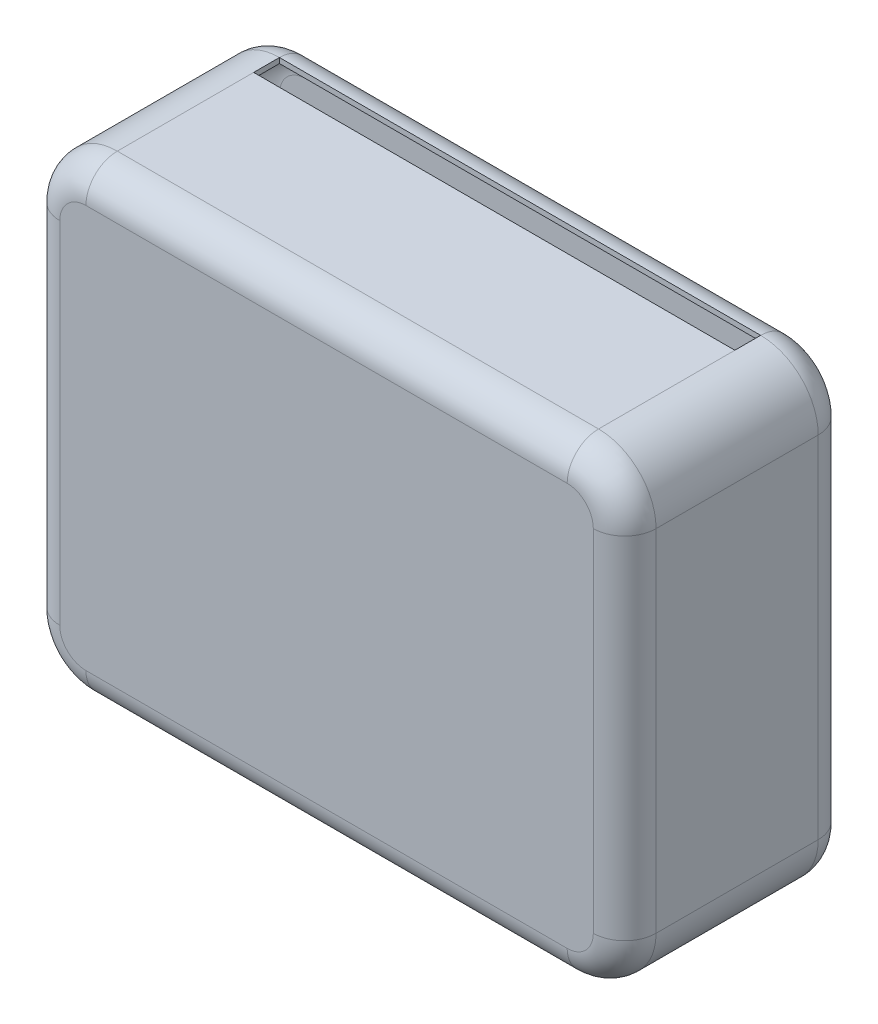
ISO-10303-21;
HEADER;
FILE_DESCRIPTION(('STEP AP214'),'2;1');
FILE_NAME('part.step','',(''),(''),'','','');
FILE_SCHEMA(('AUTOMOTIVE_DESIGN { 1 0 10303 214 1 1 1 1 }'));
ENDSEC;
DATA;
#1=APPLICATION_CONTEXT('core data for automotive mechanical design processes');
#2=APPLICATION_PROTOCOL_DEFINITION('international standard','automotive_design',2000,#1);
#3=PRODUCT_CONTEXT('',#1,'mechanical');
#4=PRODUCT('Part','Part','',(#3));
#5=PRODUCT_RELATED_PRODUCT_CATEGORY('part','',(#4));
#6=PRODUCT_DEFINITION_FORMATION('','',#4);
#7=PRODUCT_DEFINITION_CONTEXT('part definition',#1,'design');
#8=PRODUCT_DEFINITION('design','',#6,#7);
#9=PRODUCT_DEFINITION_SHAPE('','',#8);
#10=(LENGTH_UNIT() NAMED_UNIT(*) SI_UNIT(.MILLI.,.METRE.));
#11=(NAMED_UNIT(*) PLANE_ANGLE_UNIT() SI_UNIT($,.RADIAN.));
#12=(NAMED_UNIT(*) SI_UNIT($,.STERADIAN.) SOLID_ANGLE_UNIT());
#13=UNCERTAINTY_MEASURE_WITH_UNIT(LENGTH_MEASURE(1.E-05),#10,'distance_accuracy_value','');
#14=(GEOMETRIC_REPRESENTATION_CONTEXT(3) GLOBAL_UNCERTAINTY_ASSIGNED_CONTEXT((#13)) GLOBAL_UNIT_ASSIGNED_CONTEXT((#10,
#11,#12)) REPRESENTATION_CONTEXT('',''));
#15=CARTESIAN_POINT('',(0.,0.,0.));
#16=DIRECTION('',(0.,0.,1.));
#17=DIRECTION('',(1.,0.,0.));
#18=AXIS2_PLACEMENT_3D('',#15,#16,#17);
#19=CARTESIAN_POINT('',(0.,0.,41.));
#20=DIRECTION('',(-1.,0.,0.));
#21=DIRECTION('',(0.,-1.,0.));
#22=AXIS2_PLACEMENT_3D('',#19,#20,#21);
#23=PLANE('',#22);
#24=DIRECTION('',(0.,0.,-1.));
#25=VECTOR('',#24,1.);
#26=CARTESIAN_POINT('',(0.,-77.,41.));
#27=LINE('',#26,#25);
#28=CARTESIAN_POINT('',(0.,-77.,36.));
#29=VERTEX_POINT('',#28);
#30=CARTESIAN_POINT('',(0.,-77.,5.));
#31=VERTEX_POINT('',#30);
#32=EDGE_CURVE('E45',#29,#31,#27,.T.);
#33=ORIENTED_EDGE('',*,*,#32,.F.);
#34=DIRECTION('',(0.,1.,0.));
#35=VECTOR('',#34,1.);
#36=CARTESIAN_POINT('',(0.,0.,36.));
#37=LINE('',#36,#35);
#38=CARTESIAN_POINT('',(0.,-10.,36.));
#39=VERTEX_POINT('',#38);
#40=EDGE_CURVE('E151',#39,#29,#37,.F.);
#41=ORIENTED_EDGE('',*,*,#40,.F.);
#42=DIRECTION('',(0.,0.,-1.));
#43=VECTOR('',#42,1.);
#44=CARTESIAN_POINT('',(0.,-10.,41.));
#45=LINE('',#44,#43);
#46=CARTESIAN_POINT('',(0.,-10.,5.));
#47=VERTEX_POINT('',#46);
#48=EDGE_CURVE('E523',#47,#39,#45,.F.);
#49=ORIENTED_EDGE('',*,*,#48,.F.);
#50=DIRECTION('',(0.,1.,0.));
#51=VECTOR('',#50,1.);
#52=CARTESIAN_POINT('',(0.,-10.,5.));
#53=LINE('',#52,#51);
#54=EDGE_CURVE('E159',#31,#47,#53,.T.);
#55=ORIENTED_EDGE('',*,*,#54,.F.);
#56=EDGE_LOOP('',(#33,#41,#49,#55));
#57=FACE_BOUND('',#56,.T.);
#58=ADVANCED_FACE('F41',(#57),#23,.T.);
#59=CARTESIAN_POINT('',(0.,0.,41.));
#60=DIRECTION('',(0.,-1.,0.));
#61=DIRECTION('',(1.,0.,0.));
#62=AXIS2_PLACEMENT_3D('',#59,#60,#61);
#63=PLANE('',#62);
#64=DIRECTION('',(-1.,0.,0.));
#65=VECTOR('',#64,1.);
#66=CARTESIAN_POINT('',(0.,0.,9.93649130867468));
#67=LINE('',#66,#65);
#68=CARTESIAN_POINT('',(-10.,0.,9.93649130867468));
#69=VERTEX_POINT('',#68);
#70=CARTESIAN_POINT('',(-102.,0.,9.93649130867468));
#71=VERTEX_POINT('',#70);
#72=EDGE_CURVE('E394',#69,#71,#67,.T.);
#73=ORIENTED_EDGE('',*,*,#72,.F.);
#74=DIRECTION('',(0.,0.,-1.));
#75=VECTOR('',#74,1.);
#76=CARTESIAN_POINT('',(-10.,0.,41.));
#77=LINE('',#76,#75);
#78=CARTESIAN_POINT('',(-10.,0.,36.));
#79=VERTEX_POINT('',#78);
#80=EDGE_CURVE('E519',#79,#69,#77,.T.);
#81=ORIENTED_EDGE('',*,*,#80,.F.);
#82=DIRECTION('',(-1.,0.,0.));
#83=VECTOR('',#82,1.);
#84=CARTESIAN_POINT('',(0.,0.,36.));
#85=LINE('',#84,#83);
#86=CARTESIAN_POINT('',(-102.,0.,36.));
#87=VERTEX_POINT('',#86);
#88=EDGE_CURVE('E509',#87,#79,#85,.F.);
#89=ORIENTED_EDGE('',*,*,#88,.F.);
#90=DIRECTION('',(0.,0.,-1.));
#91=VECTOR('',#90,1.);
#92=CARTESIAN_POINT('',(-102.,0.,41.));
#93=LINE('',#92,#91);
#94=EDGE_CURVE('E515',#71,#87,#93,.F.);
#95=ORIENTED_EDGE('',*,*,#94,.F.);
#96=EDGE_LOOP('',(#73,#81,#89,#95));
#97=FACE_BOUND('',#96,.T.);
#98=ADVANCED_FACE('F676',(#97),#63,.T.);
#99=CARTESIAN_POINT('',(-112.,0.,41.));
#100=DIRECTION('',(1.,0.,0.));
#101=DIRECTION('',(0.,1.,0.));
#102=AXIS2_PLACEMENT_3D('',#99,#100,#101);
#103=PLANE('',#102);
#104=DIRECTION('',(0.,0.,-1.));
#105=VECTOR('',#104,1.);
#106=CARTESIAN_POINT('',(-112.,-10.,41.));
#107=LINE('',#106,#105);
#108=CARTESIAN_POINT('',(-112.,-10.,36.));
#109=VERTEX_POINT('',#108);
#110=CARTESIAN_POINT('',(-112.,-10.,5.));
#111=VERTEX_POINT('',#110);
#112=EDGE_CURVE('E506',#109,#111,#107,.T.);
#113=ORIENTED_EDGE('',*,*,#112,.F.);
#114=DIRECTION('',(0.,-1.,0.));
#115=VECTOR('',#114,1.);
#116=CARTESIAN_POINT('',(-112.,0.,36.));
#117=LINE('',#116,#115);
#118=CARTESIAN_POINT('',(-112.,-77.,36.));
#119=VERTEX_POINT('',#118);
#120=EDGE_CURVE('E498',#119,#109,#117,.F.);
#121=ORIENTED_EDGE('',*,*,#120,.F.);
#122=DIRECTION('',(0.,0.,-1.));
#123=VECTOR('',#122,1.);
#124=CARTESIAN_POINT('',(-112.,-77.,41.));
#125=LINE('',#124,#123);
#126=CARTESIAN_POINT('',(-112.,-77.,5.));
#127=VERTEX_POINT('',#126);
#128=EDGE_CURVE('E500',#127,#119,#125,.F.);
#129=ORIENTED_EDGE('',*,*,#128,.F.);
#130=DIRECTION('',(0.,-1.,0.));
#131=VECTOR('',#130,1.);
#132=CARTESIAN_POINT('',(-112.,-77.,5.));
#133=LINE('',#132,#131);
#134=EDGE_CURVE('E503',#111,#127,#133,.T.);
#135=ORIENTED_EDGE('',*,*,#134,.F.);
#136=EDGE_LOOP('',(#113,#121,#129,#135));
#137=FACE_BOUND('',#136,.T.);
#138=ADVANCED_FACE('F683',(#137),#103,.T.);
#139=CARTESIAN_POINT('',(0.,-87.,41.));
#140=DIRECTION('',(0.,1.,0.));
#141=DIRECTION('',(-1.,0.,0.));
#142=AXIS2_PLACEMENT_3D('',#139,#140,#141);
#143=PLANE('',#142);
#144=DIRECTION('',(0.,0.,-1.));
#145=VECTOR('',#144,1.);
#146=CARTESIAN_POINT('',(-102.,-87.,41.));
#147=LINE('',#146,#145);
#148=CARTESIAN_POINT('',(-102.,-87.,36.));
#149=VERTEX_POINT('',#148);
#150=CARTESIAN_POINT('',(-102.,-87.,5.));
#151=VERTEX_POINT('',#150);
#152=EDGE_CURVE('E495',#149,#151,#147,.T.);
#153=ORIENTED_EDGE('',*,*,#152,.F.);
#154=DIRECTION('',(1.,0.,0.));
#155=VECTOR('',#154,1.);
#156=CARTESIAN_POINT('',(0.,-87.,36.));
#157=LINE('',#156,#155);
#158=CARTESIAN_POINT('',(-9.99999999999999,-87.,36.));
#159=VERTEX_POINT('',#158);
#160=EDGE_CURVE('E488',#159,#149,#157,.F.);
#161=ORIENTED_EDGE('',*,*,#160,.F.);
#162=DIRECTION('',(0.,0.,-1.));
#163=VECTOR('',#162,1.);
#164=CARTESIAN_POINT('',(-9.99999999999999,-87.,41.));
#165=LINE('',#164,#163);
#166=CARTESIAN_POINT('',(-9.99999999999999,-87.,5.));
#167=VERTEX_POINT('',#166);
#168=EDGE_CURVE('E490',#167,#159,#165,.F.);
#169=ORIENTED_EDGE('',*,*,#168,.F.);
#170=DIRECTION('',(1.,0.,0.));
#171=VECTOR('',#170,1.);
#172=CARTESIAN_POINT('',(-9.99999999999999,-87.,5.));
#173=LINE('',#172,#171);
#174=EDGE_CURVE('E493',#151,#167,#173,.T.);
#175=ORIENTED_EDGE('',*,*,#174,.F.);
#176=EDGE_LOOP('',(#153,#161,#169,#175));
#177=FACE_BOUND('',#176,.T.);
#178=ADVANCED_FACE('F689',(#177),#143,.T.);
#179=CARTESIAN_POINT('',(0.,0.,41.));
#180=DIRECTION('',(0.,0.,-1.));
#181=DIRECTION('',(-1.,0.,0.));
#182=AXIS2_PLACEMENT_3D('',#179,#180,#181);
#183=PLANE('',#182);
#184=CARTESIAN_POINT('',(-10.,-10.,41.));
#185=DIRECTION('',(0.,0.,-1.));
#186=DIRECTION('',(-1.,0.,0.));
#187=AXIS2_PLACEMENT_3D('',#184,#185,#186);
#188=CIRCLE('',#187,5.);
#189=CARTESIAN_POINT('',(-5.,-10.,41.));
#190=VERTEX_POINT('',#189);
#191=CARTESIAN_POINT('',(-10.,-5.,41.));
#192=VERTEX_POINT('',#191);
#193=EDGE_CURVE('E486',#190,#192,#188,.F.);
#194=ORIENTED_EDGE('',*,*,#193,.F.);
#195=DIRECTION('',(0.,1.,0.));
#196=VECTOR('',#195,1.);
#197=CARTESIAN_POINT('',(-5.,0.,41.));
#198=LINE('',#197,#196);
#199=CARTESIAN_POINT('',(-4.99999999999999,-77.,41.));
#200=VERTEX_POINT('',#199);
#201=EDGE_CURVE('E471',#200,#190,#198,.T.);
#202=ORIENTED_EDGE('',*,*,#201,.F.);
#203=CARTESIAN_POINT('',(-9.99999999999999,-77.,41.));
#204=DIRECTION('',(0.,0.,-1.));
#205=DIRECTION('',(-1.,0.,0.));
#206=AXIS2_PLACEMENT_3D('',#203,#204,#205);
#207=CIRCLE('',#206,5.);
#208=CARTESIAN_POINT('',(-9.99999999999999,-82.,41.));
#209=VERTEX_POINT('',#208);
#210=EDGE_CURVE('E473',#209,#200,#207,.F.);
#211=ORIENTED_EDGE('',*,*,#210,.F.);
#212=DIRECTION('',(1.,0.,0.));
#213=VECTOR('',#212,1.);
#214=CARTESIAN_POINT('',(0.,-82.,41.));
#215=LINE('',#214,#213);
#216=CARTESIAN_POINT('',(-102.,-82.,41.));
#217=VERTEX_POINT('',#216);
#218=EDGE_CURVE('E475',#217,#209,#215,.T.);
#219=ORIENTED_EDGE('',*,*,#218,.F.);
#220=CARTESIAN_POINT('',(-102.,-77.,41.));
#221=DIRECTION('',(0.,0.,-1.));
#222=DIRECTION('',(-1.,0.,0.));
#223=AXIS2_PLACEMENT_3D('',#220,#221,#222);
#224=CIRCLE('',#223,5.);
#225=CARTESIAN_POINT('',(-107.,-77.,41.));
#226=VERTEX_POINT('',#225);
#227=EDGE_CURVE('E477',#226,#217,#224,.F.);
#228=ORIENTED_EDGE('',*,*,#227,.F.);
#229=DIRECTION('',(0.,-1.,0.));
#230=VECTOR('',#229,1.);
#231=CARTESIAN_POINT('',(-107.,0.,41.));
#232=LINE('',#231,#230);
#233=CARTESIAN_POINT('',(-107.,-10.,41.));
#234=VERTEX_POINT('',#233);
#235=EDGE_CURVE('E479',#234,#226,#232,.T.);
#236=ORIENTED_EDGE('',*,*,#235,.F.);
#237=CARTESIAN_POINT('',(-102.,-10.,41.));
#238=DIRECTION('',(0.,0.,-1.));
#239=DIRECTION('',(-1.,0.,0.));
#240=AXIS2_PLACEMENT_3D('',#237,#238,#239);
#241=CIRCLE('',#240,5.);
#242=CARTESIAN_POINT('',(-102.,-5.00000000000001,41.));
#243=VERTEX_POINT('',#242);
#244=EDGE_CURVE('E481',#243,#234,#241,.F.);
#245=ORIENTED_EDGE('',*,*,#244,.F.);
#246=DIRECTION('',(-1.,0.,0.));
#247=VECTOR('',#246,1.);
#248=CARTESIAN_POINT('',(0.,-5.,41.));
#249=LINE('',#248,#247);
#250=EDGE_CURVE('E483',#192,#243,#249,.T.);
#251=ORIENTED_EDGE('',*,*,#250,.F.);
#252=EDGE_LOOP('',(#194,#202,#211,#219,#228,#236,#245,#251));
#253=FACE_BOUND('',#252,.T.);
#254=ADVANCED_FACE('F693',(#253),#183,.T.);
#255=CARTESIAN_POINT('',(0.,0.,0.));
#256=DIRECTION('',(0.,0.,-1.));
#257=DIRECTION('',(-1.,0.,0.));
#258=AXIS2_PLACEMENT_3D('',#255,#256,#257);
#259=PLANE('',#258);
#260=CARTESIAN_POINT('',(-102.,-77.,0.));
#261=DIRECTION('',(0.,0.,-1.));
#262=DIRECTION('',(-1.,0.,0.));
#263=AXIS2_PLACEMENT_3D('',#260,#261,#262);
#264=CIRCLE('',#263,5.);
#265=CARTESIAN_POINT('',(-102.,-82.,0.));
#266=VERTEX_POINT('',#265);
#267=CARTESIAN_POINT('',(-107.,-77.,0.));
#268=VERTEX_POINT('',#267);
#269=EDGE_CURVE('E469',#266,#268,#264,.T.);
#270=ORIENTED_EDGE('',*,*,#269,.F.);
#271=DIRECTION('',(1.,0.,0.));
#272=VECTOR('',#271,1.);
#273=CARTESIAN_POINT('',(-102.,-82.,0.));
#274=LINE('',#273,#272);
#275=CARTESIAN_POINT('',(-9.99999999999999,-82.,0.));
#276=VERTEX_POINT('',#275);
#277=EDGE_CURVE('E454',#276,#266,#274,.F.);
#278=ORIENTED_EDGE('',*,*,#277,.F.);
#279=CARTESIAN_POINT('',(-9.99999999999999,-77.,0.));
#280=DIRECTION('',(0.,0.,-1.));
#281=DIRECTION('',(-1.,0.,0.));
#282=AXIS2_PLACEMENT_3D('',#279,#280,#281);
#283=CIRCLE('',#282,5.);
#284=CARTESIAN_POINT('',(-4.99999999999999,-77.,0.));
#285=VERTEX_POINT('',#284);
#286=EDGE_CURVE('E456',#285,#276,#283,.T.);
#287=ORIENTED_EDGE('',*,*,#286,.F.);
#288=DIRECTION('',(0.,1.,0.));
#289=VECTOR('',#288,1.);
#290=CARTESIAN_POINT('',(-4.99999999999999,-77.,0.));
#291=LINE('',#290,#289);
#292=CARTESIAN_POINT('',(-5.,-10.,0.));
#293=VERTEX_POINT('',#292);
#294=EDGE_CURVE('E458',#293,#285,#291,.F.);
#295=ORIENTED_EDGE('',*,*,#294,.F.);
#296=CARTESIAN_POINT('',(-10.,-10.,0.));
#297=DIRECTION('',(0.,0.,-1.));
#298=DIRECTION('',(-1.,0.,0.));
#299=AXIS2_PLACEMENT_3D('',#296,#297,#298);
#300=CIRCLE('',#299,5.);
#301=CARTESIAN_POINT('',(-10.,-5.,0.));
#302=VERTEX_POINT('',#301);
#303=EDGE_CURVE('E460',#302,#293,#300,.T.);
#304=ORIENTED_EDGE('',*,*,#303,.F.);
#305=DIRECTION('',(-1.,0.,0.));
#306=VECTOR('',#305,1.);
#307=CARTESIAN_POINT('',(-10.,-5.,0.));
#308=LINE('',#307,#306);
#309=CARTESIAN_POINT('',(-102.,-5.00000000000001,0.));
#310=VERTEX_POINT('',#309);
#311=EDGE_CURVE('E462',#310,#302,#308,.F.);
#312=ORIENTED_EDGE('',*,*,#311,.F.);
#313=CARTESIAN_POINT('',(-102.,-10.,0.));
#314=DIRECTION('',(0.,0.,-1.));
#315=DIRECTION('',(-1.,0.,0.));
#316=AXIS2_PLACEMENT_3D('',#313,#314,#315);
#317=CIRCLE('',#316,5.);
#318=CARTESIAN_POINT('',(-107.,-10.,0.));
#319=VERTEX_POINT('',#318);
#320=EDGE_CURVE('E464',#319,#310,#317,.T.);
#321=ORIENTED_EDGE('',*,*,#320,.F.);
#322=DIRECTION('',(0.,-1.,0.));
#323=VECTOR('',#322,1.);
#324=CARTESIAN_POINT('',(-107.,-10.,0.));
#325=LINE('',#324,#323);
#326=EDGE_CURVE('E466',#268,#319,#325,.F.);
#327=ORIENTED_EDGE('',*,*,#326,.F.);
#328=EDGE_LOOP('',(#270,#278,#287,#295,#304,#312,#321,#327));
#329=FACE_BOUND('',#328,.T.);
#330=ADVANCED_FACE('F697',(#329),#259,.F.);
#331=CARTESIAN_POINT('',(-10.,-10.,41.));
#332=DIRECTION('',(0.,0.,-1.));
#333=DIRECTION('',(-1.,0.,0.));
#334=AXIS2_PLACEMENT_3D('',#331,#332,#333);
#335=CYLINDRICAL_SURFACE('',#334,10.);
#336=ORIENTED_EDGE('',*,*,#48,.T.);
#337=CARTESIAN_POINT('',(-10.,-10.,36.));
#338=DIRECTION('',(0.,0.,-1.));
#339=DIRECTION('',(-1.,0.,0.));
#340=AXIS2_PLACEMENT_3D('',#337,#338,#339);
#341=CIRCLE('',#340,10.);
#342=EDGE_CURVE('E449',#79,#39,#341,.T.);
#343=ORIENTED_EDGE('',*,*,#342,.F.);
#344=ORIENTED_EDGE('',*,*,#80,.T.);
#345=DIRECTION('',(0.,0.,-1.));
#346=VECTOR('',#345,1.);
#347=CARTESIAN_POINT('',(-10.,0.,41.));
#348=LINE('',#347,#346);
#349=CARTESIAN_POINT('',(-10.,0.,5.));
#350=VERTEX_POINT('',#349);
#351=EDGE_CURVE('E559',#69,#350,#348,.T.);
#352=ORIENTED_EDGE('',*,*,#351,.T.);
#353=CARTESIAN_POINT('',(-10.,-10.,5.));
#354=DIRECTION('',(0.,0.,-1.));
#355=DIRECTION('',(-1.,0.,0.));
#356=AXIS2_PLACEMENT_3D('',#353,#354,#355);
#357=CIRCLE('',#356,10.);
#358=EDGE_CURVE('E451',#47,#350,#357,.F.);
#359=ORIENTED_EDGE('',*,*,#358,.F.);
#360=EDGE_LOOP('',(#336,#343,#344,#352,#359));
#361=FACE_BOUND('',#360,.T.);
#362=ADVANCED_FACE('F701',(#361),#335,.F.);
#363=CARTESIAN_POINT('',(-102.,-10.,41.));
#364=DIRECTION('',(0.,0.,-1.));
#365=DIRECTION('',(-1.,0.,0.));
#366=AXIS2_PLACEMENT_3D('',#363,#364,#365);
#367=CYLINDRICAL_SURFACE('',#366,10.);
#368=CARTESIAN_POINT('',(-102.,0.,5.));
#369=VERTEX_POINT('',#368);
#370=EDGE_CURVE('E512',#369,#71,#93,.F.);
#371=ORIENTED_EDGE('',*,*,#370,.T.);
#372=ORIENTED_EDGE('',*,*,#94,.T.);
#373=CARTESIAN_POINT('',(-102.,-10.,36.));
#374=DIRECTION('',(0.,0.,-1.));
#375=DIRECTION('',(-1.,0.,0.));
#376=AXIS2_PLACEMENT_3D('',#373,#374,#375);
#377=CIRCLE('',#376,10.);
#378=EDGE_CURVE('E445',#109,#87,#377,.T.);
#379=ORIENTED_EDGE('',*,*,#378,.F.);
#380=ORIENTED_EDGE('',*,*,#112,.T.);
#381=CARTESIAN_POINT('',(-102.,-10.,5.));
#382=DIRECTION('',(0.,0.,-1.));
#383=DIRECTION('',(-1.,0.,0.));
#384=AXIS2_PLACEMENT_3D('',#381,#382,#383);
#385=CIRCLE('',#384,10.);
#386=EDGE_CURVE('E447',#369,#111,#385,.F.);
#387=ORIENTED_EDGE('',*,*,#386,.F.);
#388=EDGE_LOOP('',(#371,#372,#379,#380,#387));
#389=FACE_BOUND('',#388,.T.);
#390=ADVANCED_FACE('F705',(#389),#367,.F.);
#391=CARTESIAN_POINT('',(-9.99999999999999,-77.,41.));
#392=DIRECTION('',(0.,0.,-1.));
#393=DIRECTION('',(-1.,0.,0.));
#394=AXIS2_PLACEMENT_3D('',#391,#392,#393);
#395=CYLINDRICAL_SURFACE('',#394,10.);
#396=ORIENTED_EDGE('',*,*,#168,.T.);
#397=CARTESIAN_POINT('',(-9.99999999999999,-77.,36.));
#398=DIRECTION('',(0.,0.,-1.));
#399=DIRECTION('',(-1.,0.,0.));
#400=AXIS2_PLACEMENT_3D('',#397,#398,#399);
#401=CIRCLE('',#400,10.);
#402=EDGE_CURVE('E441',#29,#159,#401,.T.);
#403=ORIENTED_EDGE('',*,*,#402,.F.);
#404=ORIENTED_EDGE('',*,*,#32,.T.);
#405=CARTESIAN_POINT('',(-9.99999999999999,-77.,5.));
#406=DIRECTION('',(0.,0.,-1.));
#407=DIRECTION('',(-1.,0.,0.));
#408=AXIS2_PLACEMENT_3D('',#405,#406,#407);
#409=CIRCLE('',#408,10.);
#410=EDGE_CURVE('E443',#167,#31,#409,.F.);
#411=ORIENTED_EDGE('',*,*,#410,.F.);
#412=EDGE_LOOP('',(#396,#403,#404,#411));
#413=FACE_BOUND('',#412,.T.);
#414=ADVANCED_FACE('F709',(#413),#395,.F.);
#415=CARTESIAN_POINT('',(-102.,-77.,41.));
#416=DIRECTION('',(0.,0.,-1.));
#417=DIRECTION('',(-1.,0.,0.));
#418=AXIS2_PLACEMENT_3D('',#415,#416,#417);
#419=CYLINDRICAL_SURFACE('',#418,10.);
#420=ORIENTED_EDGE('',*,*,#128,.T.);
#421=CARTESIAN_POINT('',(-102.,-77.,36.));
#422=DIRECTION('',(0.,0.,-1.));
#423=DIRECTION('',(-1.,0.,0.));
#424=AXIS2_PLACEMENT_3D('',#421,#422,#423);
#425=CIRCLE('',#424,10.);
#426=EDGE_CURVE('E437',#149,#119,#425,.T.);
#427=ORIENTED_EDGE('',*,*,#426,.F.);
#428=ORIENTED_EDGE('',*,*,#152,.T.);
#429=CARTESIAN_POINT('',(-102.,-77.,5.));
#430=DIRECTION('',(0.,0.,-1.));
#431=DIRECTION('',(-1.,0.,0.));
#432=AXIS2_PLACEMENT_3D('',#429,#430,#431);
#433=CIRCLE('',#432,10.);
#434=EDGE_CURVE('E439',#127,#151,#433,.F.);
#435=ORIENTED_EDGE('',*,*,#434,.F.);
#436=EDGE_LOOP('',(#420,#427,#428,#435));
#437=FACE_BOUND('',#436,.T.);
#438=ADVANCED_FACE('F713',(#437),#419,.F.);
#439=CARTESIAN_POINT('',(-5.,0.,5.));
#440=DIRECTION('',(0.,-1.,0.));
#441=DIRECTION('',(1.,0.,0.));
#442=AXIS2_PLACEMENT_3D('',#439,#440,#441);
#443=CYLINDRICAL_SURFACE('',#442,5.);
#444=CARTESIAN_POINT('',(-4.99999999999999,-77.,5.));
#445=DIRECTION('',(0.,-1.,0.));
#446=DIRECTION('',(0.,0.,-1.));
#447=AXIS2_PLACEMENT_3D('',#444,#445,#446);
#448=CIRCLE('',#447,5.);
#449=EDGE_CURVE('E433',#285,#31,#448,.T.);
#450=ORIENTED_EDGE('',*,*,#449,.T.);
#451=ORIENTED_EDGE('',*,*,#54,.T.);
#452=CARTESIAN_POINT('',(-5.,-10.,5.));
#453=DIRECTION('',(0.,1.,0.));
#454=DIRECTION('',(0.,0.,1.));
#455=AXIS2_PLACEMENT_3D('',#452,#453,#454);
#456=CIRCLE('',#455,5.);
#457=EDGE_CURVE('E435',#47,#293,#456,.T.);
#458=ORIENTED_EDGE('',*,*,#457,.T.);
#459=ORIENTED_EDGE('',*,*,#294,.T.);
#460=EDGE_LOOP('',(#450,#451,#458,#459));
#461=FACE_BOUND('',#460,.T.);
#462=ADVANCED_FACE('F716',(#461),#443,.F.);
#463=CARTESIAN_POINT('',(-10.,-10.,5.));
#464=DIRECTION('',(0.,0.,-1.));
#465=DIRECTION('',(-1.,0.,0.));
#466=AXIS2_PLACEMENT_3D('',#463,#464,#465);
#467=DEGENERATE_TOROIDAL_SURFACE('',#466,5.,5.,.T.);
#468=ORIENTED_EDGE('',*,*,#457,.F.);
#469=ORIENTED_EDGE('',*,*,#358,.T.);
#470=CARTESIAN_POINT('',(-10.,-5.,5.));
#471=DIRECTION('',(-1.,0.,0.));
#472=DIRECTION('',(0.,-1.,0.));
#473=AXIS2_PLACEMENT_3D('',#470,#471,#472);
#474=CIRCLE('',#473,5.);
#475=EDGE_CURVE('E430',#350,#302,#474,.T.);
#476=ORIENTED_EDGE('',*,*,#475,.T.);
#477=ORIENTED_EDGE('',*,*,#303,.T.);
#478=EDGE_LOOP('',(#468,#469,#476,#477));
#479=FACE_BOUND('',#478,.T.);
#480=ADVANCED_FACE('F720',(#479),#467,.F.);
#481=CARTESIAN_POINT('',(-9.99999999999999,-77.,5.));
#482=DIRECTION('',(0.,0.,-1.));
#483=DIRECTION('',(-1.,0.,0.));
#484=AXIS2_PLACEMENT_3D('',#481,#482,#483);
#485=DEGENERATE_TOROIDAL_SURFACE('',#484,5.,5.,.T.);
#486=ORIENTED_EDGE('',*,*,#449,.F.);
#487=ORIENTED_EDGE('',*,*,#286,.T.);
#488=CARTESIAN_POINT('',(-9.99999999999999,-82.,5.));
#489=DIRECTION('',(-1.,0.,0.));
#490=DIRECTION('',(0.,0.,1.));
#491=AXIS2_PLACEMENT_3D('',#488,#489,#490);
#492=CIRCLE('',#491,5.);
#493=EDGE_CURVE('E427',#276,#167,#492,.T.);
#494=ORIENTED_EDGE('',*,*,#493,.T.);
#495=ORIENTED_EDGE('',*,*,#410,.T.);
#496=EDGE_LOOP('',(#486,#487,#494,#495));
#497=FACE_BOUND('',#496,.T.);
#498=ADVANCED_FACE('F723',(#497),#485,.F.);
#499=CARTESIAN_POINT('',(0.,-5.,5.));
#500=DIRECTION('',(1.,0.,0.));
#501=DIRECTION('',(0.,1.,0.));
#502=AXIS2_PLACEMENT_3D('',#499,#500,#501);
#503=CYLINDRICAL_SURFACE('',#502,5.);
#504=ORIENTED_EDGE('',*,*,#475,.F.);
#505=DIRECTION('',(-1.,0.,0.));
#506=VECTOR('',#505,1.);
#507=CARTESIAN_POINT('',(-102.,0.,5.));
#508=LINE('',#507,#506);
#509=EDGE_CURVE('E516',#350,#369,#508,.T.);
#510=ORIENTED_EDGE('',*,*,#509,.T.);
#511=CARTESIAN_POINT('',(-102.,-5.00000000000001,5.));
#512=DIRECTION('',(-1.,0.,0.));
#513=DIRECTION('',(0.,0.,1.));
#514=AXIS2_PLACEMENT_3D('',#511,#512,#513);
#515=CIRCLE('',#514,5.);
#516=EDGE_CURVE('E424',#369,#310,#515,.T.);
#517=ORIENTED_EDGE('',*,*,#516,.T.);
#518=ORIENTED_EDGE('',*,*,#311,.T.);
#519=EDGE_LOOP('',(#504,#510,#517,#518));
#520=FACE_BOUND('',#519,.T.);
#521=ADVANCED_FACE('F727',(#520),#503,.F.);
#522=CARTESIAN_POINT('',(0.,-82.,5.));
#523=DIRECTION('',(-1.,0.,0.));
#524=DIRECTION('',(0.,-1.,0.));
#525=AXIS2_PLACEMENT_3D('',#522,#523,#524);
#526=CYLINDRICAL_SURFACE('',#525,5.);
#527=ORIENTED_EDGE('',*,*,#493,.F.);
#528=ORIENTED_EDGE('',*,*,#277,.T.);
#529=CARTESIAN_POINT('',(-102.,-82.,5.));
#530=DIRECTION('',(-1.,0.,0.));
#531=DIRECTION('',(0.,0.,1.));
#532=AXIS2_PLACEMENT_3D('',#529,#530,#531);
#533=CIRCLE('',#532,5.);
#534=EDGE_CURVE('E421',#266,#151,#533,.T.);
#535=ORIENTED_EDGE('',*,*,#534,.T.);
#536=ORIENTED_EDGE('',*,*,#174,.T.);
#537=EDGE_LOOP('',(#527,#528,#535,#536));
#538=FACE_BOUND('',#537,.T.);
#539=ADVANCED_FACE('F731',(#538),#526,.F.);
#540=CARTESIAN_POINT('',(-102.,-10.,5.));
#541=DIRECTION('',(0.,0.,-1.));
#542=DIRECTION('',(-1.,0.,0.));
#543=AXIS2_PLACEMENT_3D('',#540,#541,#542);
#544=DEGENERATE_TOROIDAL_SURFACE('',#543,5.,5.,.T.);
#545=ORIENTED_EDGE('',*,*,#516,.F.);
#546=ORIENTED_EDGE('',*,*,#386,.T.);
#547=CARTESIAN_POINT('',(-107.,-10.,5.));
#548=DIRECTION('',(0.,-1.,0.));
#549=DIRECTION('',(1.,0.,0.));
#550=AXIS2_PLACEMENT_3D('',#547,#548,#549);
#551=CIRCLE('',#550,5.);
#552=EDGE_CURVE('E419',#111,#319,#551,.T.);
#553=ORIENTED_EDGE('',*,*,#552,.T.);
#554=ORIENTED_EDGE('',*,*,#320,.T.);
#555=EDGE_LOOP('',(#545,#546,#553,#554));
#556=FACE_BOUND('',#555,.T.);
#557=ADVANCED_FACE('F735',(#556),#544,.F.);
#558=CARTESIAN_POINT('',(-102.,-77.,5.));
#559=DIRECTION('',(0.,0.,-1.));
#560=DIRECTION('',(-1.,0.,0.));
#561=AXIS2_PLACEMENT_3D('',#558,#559,#560);
#562=DEGENERATE_TOROIDAL_SURFACE('',#561,5.,5.,.T.);
#563=ORIENTED_EDGE('',*,*,#534,.F.);
#564=ORIENTED_EDGE('',*,*,#269,.T.);
#565=CARTESIAN_POINT('',(-107.,-77.,5.));
#566=DIRECTION('',(0.,1.,0.));
#567=DIRECTION('',(0.,0.,1.));
#568=AXIS2_PLACEMENT_3D('',#565,#566,#567);
#569=CIRCLE('',#568,5.);
#570=EDGE_CURVE('E417',#268,#127,#569,.T.);
#571=ORIENTED_EDGE('',*,*,#570,.T.);
#572=ORIENTED_EDGE('',*,*,#434,.T.);
#573=EDGE_LOOP('',(#563,#564,#571,#572));
#574=FACE_BOUND('',#573,.T.);
#575=ADVANCED_FACE('F739',(#574),#562,.F.);
#576=CARTESIAN_POINT('',(-107.,0.,5.));
#577=DIRECTION('',(0.,1.,0.));
#578=DIRECTION('',(-1.,0.,0.));
#579=AXIS2_PLACEMENT_3D('',#576,#577,#578);
#580=CYLINDRICAL_SURFACE('',#579,5.);
#581=ORIENTED_EDGE('',*,*,#552,.F.);
#582=ORIENTED_EDGE('',*,*,#134,.T.);
#583=ORIENTED_EDGE('',*,*,#570,.F.);
#584=ORIENTED_EDGE('',*,*,#326,.T.);
#585=EDGE_LOOP('',(#581,#582,#583,#584));
#586=FACE_BOUND('',#585,.T.);
#587=ADVANCED_FACE('F743',(#586),#580,.F.);
#588=CARTESIAN_POINT('',(0.,-82.,36.));
#589=DIRECTION('',(1.,0.,0.));
#590=DIRECTION('',(0.,1.,0.));
#591=AXIS2_PLACEMENT_3D('',#588,#589,#590);
#592=CYLINDRICAL_SURFACE('',#591,5.);
#593=CARTESIAN_POINT('',(-102.,-82.,36.));
#594=DIRECTION('',(-1.,0.,0.));
#595=DIRECTION('',(0.,0.,1.));
#596=AXIS2_PLACEMENT_3D('',#593,#594,#595);
#597=CIRCLE('',#596,5.);
#598=EDGE_CURVE('E411',#149,#217,#597,.T.);
#599=ORIENTED_EDGE('',*,*,#598,.T.);
#600=ORIENTED_EDGE('',*,*,#218,.T.);
#601=CARTESIAN_POINT('',(-9.99999999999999,-82.,36.));
#602=DIRECTION('',(1.,0.,0.));
#603=DIRECTION('',(0.,1.,0.));
#604=AXIS2_PLACEMENT_3D('',#601,#602,#603);
#605=CIRCLE('',#604,5.);
#606=EDGE_CURVE('E414',#209,#159,#605,.T.);
#607=ORIENTED_EDGE('',*,*,#606,.T.);
#608=ORIENTED_EDGE('',*,*,#160,.T.);
#609=EDGE_LOOP('',(#599,#600,#607,#608));
#610=FACE_BOUND('',#609,.T.);
#611=ADVANCED_FACE('F747',(#610),#592,.F.);
#612=CARTESIAN_POINT('',(-9.99999999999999,-77.,36.));
#613=DIRECTION('',(0.,0.,-1.));
#614=DIRECTION('',(-1.,0.,0.));
#615=AXIS2_PLACEMENT_3D('',#612,#613,#614);
#616=DEGENERATE_TOROIDAL_SURFACE('',#615,5.,5.,.T.);
#617=ORIENTED_EDGE('',*,*,#606,.F.);
#618=ORIENTED_EDGE('',*,*,#210,.T.);
#619=CARTESIAN_POINT('',(-4.99999999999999,-77.,36.));
#620=DIRECTION('',(0.,1.,0.));
#621=DIRECTION('',(0.,0.,1.));
#622=AXIS2_PLACEMENT_3D('',#619,#620,#621);
#623=CIRCLE('',#622,5.);
#624=EDGE_CURVE('E408',#200,#29,#623,.T.);
#625=ORIENTED_EDGE('',*,*,#624,.T.);
#626=ORIENTED_EDGE('',*,*,#402,.T.);
#627=EDGE_LOOP('',(#617,#618,#625,#626));
#628=FACE_BOUND('',#627,.T.);
#629=ADVANCED_FACE('F751',(#628),#616,.F.);
#630=CARTESIAN_POINT('',(-102.,-77.,36.));
#631=DIRECTION('',(0.,0.,-1.));
#632=DIRECTION('',(-1.,0.,0.));
#633=AXIS2_PLACEMENT_3D('',#630,#631,#632);
#634=DEGENERATE_TOROIDAL_SURFACE('',#633,5.,5.,.T.);
#635=ORIENTED_EDGE('',*,*,#598,.F.);
#636=ORIENTED_EDGE('',*,*,#426,.T.);
#637=CARTESIAN_POINT('',(-107.,-77.,36.));
#638=DIRECTION('',(0.,1.,0.));
#639=DIRECTION('',(0.,0.,1.));
#640=AXIS2_PLACEMENT_3D('',#637,#638,#639);
#641=CIRCLE('',#640,5.);
#642=EDGE_CURVE('E405',#119,#226,#641,.T.);
#643=ORIENTED_EDGE('',*,*,#642,.T.);
#644=ORIENTED_EDGE('',*,*,#227,.T.);
#645=EDGE_LOOP('',(#635,#636,#643,#644));
#646=FACE_BOUND('',#645,.T.);
#647=ADVANCED_FACE('F755',(#646),#634,.F.);
#648=CARTESIAN_POINT('',(-5.,0.,36.));
#649=DIRECTION('',(0.,1.,0.));
#650=DIRECTION('',(-1.,0.,0.));
#651=AXIS2_PLACEMENT_3D('',#648,#649,#650);
#652=CYLINDRICAL_SURFACE('',#651,5.);
#653=ORIENTED_EDGE('',*,*,#624,.F.);
#654=ORIENTED_EDGE('',*,*,#201,.T.);
#655=CARTESIAN_POINT('',(-5.,-10.,36.));
#656=DIRECTION('',(0.,1.,0.));
#657=DIRECTION('',(-1.,0.,0.));
#658=AXIS2_PLACEMENT_3D('',#655,#656,#657);
#659=CIRCLE('',#658,5.);
#660=EDGE_CURVE('E403',#190,#39,#659,.T.);
#661=ORIENTED_EDGE('',*,*,#660,.T.);
#662=ORIENTED_EDGE('',*,*,#40,.T.);
#663=EDGE_LOOP('',(#653,#654,#661,#662));
#664=FACE_BOUND('',#663,.T.);
#665=ADVANCED_FACE('F759',(#664),#652,.F.);
#666=CARTESIAN_POINT('',(-107.,0.,36.));
#667=DIRECTION('',(0.,-1.,0.));
#668=DIRECTION('',(1.,0.,0.));
#669=AXIS2_PLACEMENT_3D('',#666,#667,#668);
#670=CYLINDRICAL_SURFACE('',#669,5.);
#671=ORIENTED_EDGE('',*,*,#642,.F.);
#672=ORIENTED_EDGE('',*,*,#120,.T.);
#673=CARTESIAN_POINT('',(-107.,-10.,36.));
#674=DIRECTION('',(0.,1.,0.));
#675=DIRECTION('',(0.,0.,1.));
#676=AXIS2_PLACEMENT_3D('',#673,#674,#675);
#677=CIRCLE('',#676,5.);
#678=EDGE_CURVE('E400',#109,#234,#677,.T.);
#679=ORIENTED_EDGE('',*,*,#678,.T.);
#680=ORIENTED_EDGE('',*,*,#235,.T.);
#681=EDGE_LOOP('',(#671,#672,#679,#680));
#682=FACE_BOUND('',#681,.T.);
#683=ADVANCED_FACE('F763',(#682),#670,.F.);
#684=CARTESIAN_POINT('',(-10.,-10.,36.));
#685=DIRECTION('',(0.,0.,-1.));
#686=DIRECTION('',(-1.,0.,0.));
#687=AXIS2_PLACEMENT_3D('',#684,#685,#686);
#688=DEGENERATE_TOROIDAL_SURFACE('',#687,5.,5.,.T.);
#689=ORIENTED_EDGE('',*,*,#660,.F.);
#690=ORIENTED_EDGE('',*,*,#193,.T.);
#691=CARTESIAN_POINT('',(-10.,-5.,36.));
#692=DIRECTION('',(-1.,0.,0.));
#693=DIRECTION('',(0.,0.,1.));
#694=AXIS2_PLACEMENT_3D('',#691,#692,#693);
#695=CIRCLE('',#694,5.);
#696=EDGE_CURVE('E51',#192,#79,#695,.T.);
#697=ORIENTED_EDGE('',*,*,#696,.T.);
#698=ORIENTED_EDGE('',*,*,#342,.T.);
#699=EDGE_LOOP('',(#689,#690,#697,#698));
#700=FACE_BOUND('',#699,.T.);
#701=ADVANCED_FACE('F766',(#700),#688,.F.);
#702=CARTESIAN_POINT('',(-102.,-10.,36.));
#703=DIRECTION('',(0.,0.,-1.));
#704=DIRECTION('',(-1.,0.,0.));
#705=AXIS2_PLACEMENT_3D('',#702,#703,#704);
#706=DEGENERATE_TOROIDAL_SURFACE('',#705,5.,5.,.T.);
#707=ORIENTED_EDGE('',*,*,#678,.F.);
#708=ORIENTED_EDGE('',*,*,#378,.T.);
#709=CARTESIAN_POINT('',(-102.,-5.00000000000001,36.));
#710=DIRECTION('',(1.,0.,0.));
#711=DIRECTION('',(0.,0.,-1.));
#712=AXIS2_PLACEMENT_3D('',#709,#710,#711);
#713=CIRCLE('',#712,5.);
#714=EDGE_CURVE('E11',#87,#243,#713,.T.);
#715=ORIENTED_EDGE('',*,*,#714,.T.);
#716=ORIENTED_EDGE('',*,*,#244,.T.);
#717=EDGE_LOOP('',(#707,#708,#715,#716));
#718=FACE_BOUND('',#717,.T.);
#719=ADVANCED_FACE('F769',(#718),#706,.F.);
#720=CARTESIAN_POINT('',(0.,-5.,36.));
#721=DIRECTION('',(-1.,0.,0.));
#722=DIRECTION('',(0.,-1.,0.));
#723=AXIS2_PLACEMENT_3D('',#720,#721,#722);
#724=CYLINDRICAL_SURFACE('',#723,5.);
#725=ORIENTED_EDGE('',*,*,#696,.F.);
#726=ORIENTED_EDGE('',*,*,#250,.T.);
#727=ORIENTED_EDGE('',*,*,#714,.F.);
#728=ORIENTED_EDGE('',*,*,#88,.T.);
#729=EDGE_LOOP('',(#725,#726,#727,#728));
#730=FACE_BOUND('',#729,.T.);
#731=ADVANCED_FACE('F43',(#730),#724,.F.);
#732=CARTESIAN_POINT('',(-10.,-9.,5.));
#733=DIRECTION('',(1.,0.,0.));
#734=DIRECTION('',(0.,1.,0.));
#735=AXIS2_PLACEMENT_3D('',#732,#733,#734);
#736=PLANE('',#735);
#737=DIRECTION('',(0.,1.,0.));
#738=VECTOR('',#737,1.);
#739=CARTESIAN_POINT('',(-10.,-9.,9.93649130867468));
#740=LINE('',#739,#738);
#741=CARTESIAN_POINT('',(-10.,0.999999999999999,9.93649130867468));
#742=VERTEX_POINT('',#741);
#743=EDGE_CURVE('E562',#69,#742,#740,.T.);
#744=ORIENTED_EDGE('',*,*,#743,.T.);
#745=DIRECTION('',(0.,0.,-1.));
#746=VECTOR('',#745,1.);
#747=CARTESIAN_POINT('',(-10.,0.999999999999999,5.));
#748=LINE('',#747,#746);
#749=CARTESIAN_POINT('',(-10.,0.999999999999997,5.));
#750=VERTEX_POINT('',#749);
#751=EDGE_CURVE('E577',#742,#750,#748,.T.);
#752=ORIENTED_EDGE('',*,*,#751,.T.);
#753=DIRECTION('',(0.,1.,0.));
#754=VECTOR('',#753,1.);
#755=CARTESIAN_POINT('',(-10.,-9.,5.));
#756=LINE('',#755,#754);
#757=EDGE_CURVE('E563',#350,#750,#756,.T.);
#758=ORIENTED_EDGE('',*,*,#757,.F.);
#759=ORIENTED_EDGE('',*,*,#351,.F.);
#760=EDGE_LOOP('',(#744,#752,#758,#759));
#761=FACE_BOUND('',#760,.T.);
#762=ADVANCED_FACE('F581',(#761),#736,.F.);
#763=CARTESIAN_POINT('',(-102.,-9.00000000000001,5.));
#764=DIRECTION('',(-1.,0.,0.));
#765=DIRECTION('',(0.,-1.,0.));
#766=AXIS2_PLACEMENT_3D('',#763,#764,#765);
#767=PLANE('',#766);
#768=DIRECTION('',(0.,1.,0.));
#769=VECTOR('',#768,1.);
#770=CARTESIAN_POINT('',(-102.,-9.00000000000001,5.));
#771=LINE('',#770,#769);
#772=CARTESIAN_POINT('',(-102.,0.999999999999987,5.));
#773=VERTEX_POINT('',#772);
#774=EDGE_CURVE('E566',#369,#773,#771,.T.);
#775=ORIENTED_EDGE('',*,*,#774,.T.);
#776=DIRECTION('',(0.,0.,1.));
#777=VECTOR('',#776,1.);
#778=CARTESIAN_POINT('',(-102.,0.999999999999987,41.));
#779=LINE('',#778,#777);
#780=CARTESIAN_POINT('',(-102.,0.999999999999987,9.93649130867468));
#781=VERTEX_POINT('',#780);
#782=EDGE_CURVE('E540',#773,#781,#779,.T.);
#783=ORIENTED_EDGE('',*,*,#782,.T.);
#784=DIRECTION('',(0.,1.,0.));
#785=VECTOR('',#784,1.);
#786=CARTESIAN_POINT('',(-102.,-9.00000000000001,9.93649130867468));
#787=LINE('',#786,#785);
#788=EDGE_CURVE('E570',#71,#781,#787,.T.);
#789=ORIENTED_EDGE('',*,*,#788,.F.);
#790=ORIENTED_EDGE('',*,*,#370,.F.);
#791=EDGE_LOOP('',(#775,#783,#789,#790));
#792=FACE_BOUND('',#791,.T.);
#793=ADVANCED_FACE('F798',(#792),#767,.F.);
#794=CARTESIAN_POINT('',(-10.,-9.,5.));
#795=DIRECTION('',(0.,0.,-1.));
#796=DIRECTION('',(-1.,0.,0.));
#797=AXIS2_PLACEMENT_3D('',#794,#795,#796);
#798=PLANE('',#797);
#799=ORIENTED_EDGE('',*,*,#757,.T.);
#800=DIRECTION('',(1.,0.,0.));
#801=VECTOR('',#800,1.);
#802=CARTESIAN_POINT('',(0.,1.,5.));
#803=LINE('',#802,#801);
#804=EDGE_CURVE('E378',#750,#773,#803,.F.);
#805=ORIENTED_EDGE('',*,*,#804,.T.);
#806=ORIENTED_EDGE('',*,*,#774,.F.);
#807=ORIENTED_EDGE('',*,*,#509,.F.);
#808=EDGE_LOOP('',(#799,#805,#806,#807));
#809=FACE_BOUND('',#808,.T.);
#810=ADVANCED_FACE('F588',(#809),#798,.F.);
#811=CARTESIAN_POINT('',(-10.,-9.,9.93649130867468));
#812=DIRECTION('',(0.,0.,1.));
#813=DIRECTION('',(1.,0.,0.));
#814=AXIS2_PLACEMENT_3D('',#811,#812,#813);
#815=PLANE('',#814);
#816=ORIENTED_EDGE('',*,*,#72,.T.);
#817=ORIENTED_EDGE('',*,*,#788,.T.);
#818=DIRECTION('',(1.,0.,0.));
#819=VECTOR('',#818,1.);
#820=CARTESIAN_POINT('',(-10.,0.999999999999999,9.93649130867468));
#821=LINE('',#820,#819);
#822=EDGE_CURVE('E567',#781,#742,#821,.T.);
#823=ORIENTED_EDGE('',*,*,#822,.T.);
#824=ORIENTED_EDGE('',*,*,#743,.F.);
#825=EDGE_LOOP('',(#816,#817,#823,#824));
#826=FACE_BOUND('',#825,.T.);
#827=ADVANCED_FACE('F795',(#826),#815,.F.);
#828=CARTESIAN_POINT('',(1.,0.,41.));
#829=DIRECTION('',(-1.,0.,0.));
#830=DIRECTION('',(0.,-1.,0.));
#831=AXIS2_PLACEMENT_3D('',#828,#829,#830);
#832=PLANE('',#831);
#833=DIRECTION('',(0.,0.,1.));
#834=VECTOR('',#833,1.);
#835=CARTESIAN_POINT('',(1.00000000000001,-77.,41.));
#836=LINE('',#835,#834);
#837=CARTESIAN_POINT('',(1.00000000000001,-77.,36.));
#838=VERTEX_POINT('',#837);
#839=CARTESIAN_POINT('',(1.00000000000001,-77.,5.));
#840=VERTEX_POINT('',#839);
#841=EDGE_CURVE('E309',#838,#840,#836,.F.);
#842=ORIENTED_EDGE('',*,*,#841,.T.);
#843=DIRECTION('',(0.,-1.,0.));
#844=VECTOR('',#843,1.);
#845=CARTESIAN_POINT('',(1.,0.,5.));
#846=LINE('',#845,#844);
#847=CARTESIAN_POINT('',(1.,-10.,5.));
#848=VERTEX_POINT('',#847);
#849=EDGE_CURVE('E547',#840,#848,#846,.F.);
#850=ORIENTED_EDGE('',*,*,#849,.T.);
#851=DIRECTION('',(0.,0.,1.));
#852=VECTOR('',#851,1.);
#853=CARTESIAN_POINT('',(1.,-10.,41.));
#854=LINE('',#853,#852);
#855=CARTESIAN_POINT('',(1.,-10.,36.));
#856=VERTEX_POINT('',#855);
#857=EDGE_CURVE('E305',#848,#856,#854,.T.);
#858=ORIENTED_EDGE('',*,*,#857,.T.);
#859=DIRECTION('',(0.,-1.,0.));
#860=VECTOR('',#859,1.);
#861=CARTESIAN_POINT('',(1.,0.,36.));
#862=LINE('',#861,#860);
#863=EDGE_CURVE('E325',#856,#838,#862,.T.);
#864=ORIENTED_EDGE('',*,*,#863,.T.);
#865=EDGE_LOOP('',(#842,#850,#858,#864));
#866=FACE_BOUND('',#865,.T.);
#867=ADVANCED_FACE('F632',(#866),#832,.F.);
#868=CARTESIAN_POINT('',(0.,1.,41.));
#869=DIRECTION('',(0.,-1.,0.));
#870=DIRECTION('',(1.,0.,0.));
#871=AXIS2_PLACEMENT_3D('',#868,#869,#870);
#872=PLANE('',#871);
#873=DIRECTION('',(0.,0.,1.));
#874=VECTOR('',#873,1.);
#875=CARTESIAN_POINT('',(-10.,0.999999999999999,41.));
#876=LINE('',#875,#874);
#877=CARTESIAN_POINT('',(-10.,0.999999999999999,36.));
#878=VERTEX_POINT('',#877);
#879=EDGE_CURVE('E543',#878,#742,#876,.F.);
#880=ORIENTED_EDGE('',*,*,#879,.T.);
#881=ORIENTED_EDGE('',*,*,#822,.F.);
#882=CARTESIAN_POINT('',(-102.,0.999999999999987,36.));
#883=VERTEX_POINT('',#882);
#884=EDGE_CURVE('E338',#781,#883,#779,.T.);
#885=ORIENTED_EDGE('',*,*,#884,.T.);
#886=DIRECTION('',(1.,0.,0.));
#887=VECTOR('',#886,1.);
#888=CARTESIAN_POINT('',(0.,1.,36.));
#889=LINE('',#888,#887);
#890=EDGE_CURVE('E536',#883,#878,#889,.T.);
#891=ORIENTED_EDGE('',*,*,#890,.T.);
#892=EDGE_LOOP('',(#880,#881,#885,#891));
#893=FACE_BOUND('',#892,.T.);
#894=ADVANCED_FACE('F799',(#893),#872,.F.);
#895=CARTESIAN_POINT('',(-113.,0.,41.));
#896=DIRECTION('',(1.,0.,0.));
#897=DIRECTION('',(0.,1.,0.));
#898=AXIS2_PLACEMENT_3D('',#895,#896,#897);
#899=PLANE('',#898);
#900=DIRECTION('',(0.,0.,1.));
#901=VECTOR('',#900,1.);
#902=CARTESIAN_POINT('',(-113.,-10.,41.));
#903=LINE('',#902,#901);
#904=CARTESIAN_POINT('',(-113.,-10.,36.));
#905=VERTEX_POINT('',#904);
#906=CARTESIAN_POINT('',(-113.,-10.,5.));
#907=VERTEX_POINT('',#906);
#908=EDGE_CURVE('E298',#905,#907,#903,.F.);
#909=ORIENTED_EDGE('',*,*,#908,.T.);
#910=DIRECTION('',(0.,1.,0.));
#911=VECTOR('',#910,1.);
#912=CARTESIAN_POINT('',(-113.,0.,5.));
#913=LINE('',#912,#911);
#914=CARTESIAN_POINT('',(-113.,-77.,5.));
#915=VERTEX_POINT('',#914);
#916=EDGE_CURVE('E271',#907,#915,#913,.F.);
#917=ORIENTED_EDGE('',*,*,#916,.T.);
#918=DIRECTION('',(0.,0.,1.));
#919=VECTOR('',#918,1.);
#920=CARTESIAN_POINT('',(-113.,-77.,41.));
#921=LINE('',#920,#919);
#922=CARTESIAN_POINT('',(-113.,-77.,36.));
#923=VERTEX_POINT('',#922);
#924=EDGE_CURVE('E295',#915,#923,#921,.T.);
#925=ORIENTED_EDGE('',*,*,#924,.T.);
#926=DIRECTION('',(0.,1.,0.));
#927=VECTOR('',#926,1.);
#928=CARTESIAN_POINT('',(-113.,0.,36.));
#929=LINE('',#928,#927);
#930=EDGE_CURVE('E301',#923,#905,#929,.T.);
#931=ORIENTED_EDGE('',*,*,#930,.T.);
#932=EDGE_LOOP('',(#909,#917,#925,#931));
#933=FACE_BOUND('',#932,.T.);
#934=ADVANCED_FACE('F294',(#933),#899,.F.);
#935=CARTESIAN_POINT('',(0.,-88.,41.));
#936=DIRECTION('',(0.,1.,0.));
#937=DIRECTION('',(-1.,0.,0.));
#938=AXIS2_PLACEMENT_3D('',#935,#936,#937);
#939=PLANE('',#938);
#940=DIRECTION('',(0.,0.,1.));
#941=VECTOR('',#940,1.);
#942=CARTESIAN_POINT('',(-102.,-88.,41.));
#943=LINE('',#942,#941);
#944=CARTESIAN_POINT('',(-102.,-88.,36.));
#945=VERTEX_POINT('',#944);
#946=CARTESIAN_POINT('',(-102.,-88.,5.));
#947=VERTEX_POINT('',#946);
#948=EDGE_CURVE('E307',#945,#947,#943,.F.);
#949=ORIENTED_EDGE('',*,*,#948,.T.);
#950=DIRECTION('',(-1.,0.,0.));
#951=VECTOR('',#950,1.);
#952=CARTESIAN_POINT('',(0.,-88.,5.));
#953=LINE('',#952,#951);
#954=CARTESIAN_POINT('',(-9.99999999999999,-88.,5.));
#955=VERTEX_POINT('',#954);
#956=EDGE_CURVE('E317',#947,#955,#953,.F.);
#957=ORIENTED_EDGE('',*,*,#956,.T.);
#958=DIRECTION('',(0.,0.,1.));
#959=VECTOR('',#958,1.);
#960=CARTESIAN_POINT('',(-9.99999999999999,-88.,41.));
#961=LINE('',#960,#959);
#962=CARTESIAN_POINT('',(-9.99999999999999,-88.,36.));
#963=VERTEX_POINT('',#962);
#964=EDGE_CURVE('E313',#955,#963,#961,.T.);
#965=ORIENTED_EDGE('',*,*,#964,.T.);
#966=DIRECTION('',(-1.,0.,0.));
#967=VECTOR('',#966,1.);
#968=CARTESIAN_POINT('',(0.,-88.,36.));
#969=LINE('',#968,#967);
#970=EDGE_CURVE('E288',#963,#945,#969,.T.);
#971=ORIENTED_EDGE('',*,*,#970,.T.);
#972=EDGE_LOOP('',(#949,#957,#965,#971));
#973=FACE_BOUND('',#972,.T.);
#974=ADVANCED_FACE('F617',(#973),#939,.F.);
#975=CARTESIAN_POINT('',(0.,0.,42.));
#976=DIRECTION('',(0.,0.,-1.));
#977=DIRECTION('',(-1.,0.,0.));
#978=AXIS2_PLACEMENT_3D('',#975,#976,#977);
#979=PLANE('',#978);
#980=CARTESIAN_POINT('',(-10.,-10.,42.));
#981=DIRECTION('',(0.,0.,-1.));
#982=DIRECTION('',(-1.,0.,0.));
#983=AXIS2_PLACEMENT_3D('',#980,#981,#982);
#984=CIRCLE('',#983,5.);
#985=CARTESIAN_POINT('',(-5.,-10.,42.));
#986=VERTEX_POINT('',#985);
#987=CARTESIAN_POINT('',(-10.,-5.,42.));
#988=VERTEX_POINT('',#987);
#989=EDGE_CURVE('E168',#986,#988,#984,.F.);
#990=ORIENTED_EDGE('',*,*,#989,.T.);
#991=DIRECTION('',(-1.,0.,0.));
#992=VECTOR('',#991,1.);
#993=CARTESIAN_POINT('',(0.,-5.,42.));
#994=LINE('',#993,#992);
#995=CARTESIAN_POINT('',(-102.,-5.00000000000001,42.));
#996=VERTEX_POINT('',#995);
#997=EDGE_CURVE('E371',#988,#996,#994,.T.);
#998=ORIENTED_EDGE('',*,*,#997,.T.);
#999=CARTESIAN_POINT('',(-102.,-10.,42.));
#1000=DIRECTION('',(0.,0.,-1.));
#1001=DIRECTION('',(-1.,0.,0.));
#1002=AXIS2_PLACEMENT_3D('',#999,#1000,#1001);
#1003=CIRCLE('',#1002,5.);
#1004=CARTESIAN_POINT('',(-107.,-10.,42.));
#1005=VERTEX_POINT('',#1004);
#1006=EDGE_CURVE('E375',#996,#1005,#1003,.F.);
#1007=ORIENTED_EDGE('',*,*,#1006,.T.);
#1008=DIRECTION('',(0.,1.,0.));
#1009=VECTOR('',#1008,1.);
#1010=CARTESIAN_POINT('',(-107.,0.,42.));
#1011=LINE('',#1010,#1009);
#1012=CARTESIAN_POINT('',(-107.,-77.,42.));
#1013=VERTEX_POINT('',#1012);
#1014=EDGE_CURVE('E377',#1005,#1013,#1011,.F.);
#1015=ORIENTED_EDGE('',*,*,#1014,.T.);
#1016=CARTESIAN_POINT('',(-102.,-77.,42.));
#1017=DIRECTION('',(0.,0.,-1.));
#1018=DIRECTION('',(-1.,0.,0.));
#1019=AXIS2_PLACEMENT_3D('',#1016,#1017,#1018);
#1020=CIRCLE('',#1019,5.);
#1021=CARTESIAN_POINT('',(-102.,-82.,42.));
#1022=VERTEX_POINT('',#1021);
#1023=EDGE_CURVE('E369',#1013,#1022,#1020,.F.);
#1024=ORIENTED_EDGE('',*,*,#1023,.T.);
#1025=DIRECTION('',(-1.,0.,0.));
#1026=VECTOR('',#1025,1.);
#1027=CARTESIAN_POINT('',(0.,-82.,42.));
#1028=LINE('',#1027,#1026);
#1029=CARTESIAN_POINT('',(-9.99999999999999,-82.,42.));
#1030=VERTEX_POINT('',#1029);
#1031=EDGE_CURVE('E365',#1022,#1030,#1028,.F.);
#1032=ORIENTED_EDGE('',*,*,#1031,.T.);
#1033=CARTESIAN_POINT('',(-9.99999999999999,-77.,42.));
#1034=DIRECTION('',(0.,0.,-1.));
#1035=DIRECTION('',(-1.,0.,0.));
#1036=AXIS2_PLACEMENT_3D('',#1033,#1034,#1035);
#1037=CIRCLE('',#1036,5.);
#1038=CARTESIAN_POINT('',(-4.99999999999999,-77.,42.));
#1039=VERTEX_POINT('',#1038);
#1040=EDGE_CURVE('E368',#1030,#1039,#1037,.F.);
#1041=ORIENTED_EDGE('',*,*,#1040,.T.);
#1042=DIRECTION('',(0.,1.,0.));
#1043=VECTOR('',#1042,1.);
#1044=CARTESIAN_POINT('',(-4.99999999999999,0.,42.));
#1045=LINE('',#1044,#1043);
#1046=EDGE_CURVE('E372',#1039,#986,#1045,.T.);
#1047=ORIENTED_EDGE('',*,*,#1046,.T.);
#1048=EDGE_LOOP('',(#990,#998,#1007,#1015,#1024,#1032,#1041,#1047));
#1049=FACE_BOUND('',#1048,.T.);
#1050=ADVANCED_FACE('F643',(#1049),#979,.F.);
#1051=CARTESIAN_POINT('',(0.,0.,-1.));
#1052=DIRECTION('',(0.,0.,-1.));
#1053=DIRECTION('',(-1.,0.,0.));
#1054=AXIS2_PLACEMENT_3D('',#1051,#1052,#1053);
#1055=PLANE('',#1054);
#1056=CARTESIAN_POINT('',(-102.,-77.,-1.));
#1057=DIRECTION('',(0.,0.,-1.));
#1058=DIRECTION('',(-1.,0.,0.));
#1059=AXIS2_PLACEMENT_3D('',#1056,#1057,#1058);
#1060=CIRCLE('',#1059,5.);
#1061=CARTESIAN_POINT('',(-102.,-82.,-1.));
#1062=VERTEX_POINT('',#1061);
#1063=CARTESIAN_POINT('',(-107.,-77.,-1.));
#1064=VERTEX_POINT('',#1063);
#1065=EDGE_CURVE('E339',#1062,#1064,#1060,.T.);
#1066=ORIENTED_EDGE('',*,*,#1065,.T.);
#1067=DIRECTION('',(0.,1.,0.));
#1068=VECTOR('',#1067,1.);
#1069=CARTESIAN_POINT('',(-107.,0.,-1.));
#1070=LINE('',#1069,#1068);
#1071=CARTESIAN_POINT('',(-107.,-10.,-1.));
#1072=VERTEX_POINT('',#1071);
#1073=EDGE_CURVE('E273',#1064,#1072,#1070,.T.);
#1074=ORIENTED_EDGE('',*,*,#1073,.T.);
#1075=CARTESIAN_POINT('',(-102.,-10.,-1.));
#1076=DIRECTION('',(0.,0.,-1.));
#1077=DIRECTION('',(-1.,0.,0.));
#1078=AXIS2_PLACEMENT_3D('',#1075,#1076,#1077);
#1079=CIRCLE('',#1078,5.);
#1080=CARTESIAN_POINT('',(-102.,-5.00000000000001,-1.));
#1081=VERTEX_POINT('',#1080);
#1082=EDGE_CURVE('E300',#1072,#1081,#1079,.T.);
#1083=ORIENTED_EDGE('',*,*,#1082,.T.);
#1084=DIRECTION('',(-1.,0.,0.));
#1085=VECTOR('',#1084,1.);
#1086=CARTESIAN_POINT('',(0.,-5.00000000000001,-1.));
#1087=LINE('',#1086,#1085);
#1088=CARTESIAN_POINT('',(-10.,-5.,-1.));
#1089=VERTEX_POINT('',#1088);
#1090=EDGE_CURVE('E344',#1081,#1089,#1087,.F.);
#1091=ORIENTED_EDGE('',*,*,#1090,.T.);
#1092=CARTESIAN_POINT('',(-10.,-10.,-1.));
#1093=DIRECTION('',(0.,0.,-1.));
#1094=DIRECTION('',(-1.,0.,0.));
#1095=AXIS2_PLACEMENT_3D('',#1092,#1093,#1094);
#1096=CIRCLE('',#1095,5.);
#1097=CARTESIAN_POINT('',(-5.,-10.,-1.));
#1098=VERTEX_POINT('',#1097);
#1099=EDGE_CURVE('E335',#1089,#1098,#1096,.T.);
#1100=ORIENTED_EDGE('',*,*,#1099,.T.);
#1101=DIRECTION('',(0.,1.,0.));
#1102=VECTOR('',#1101,1.);
#1103=CARTESIAN_POINT('',(-5.,0.,-1.));
#1104=LINE('',#1103,#1102);
#1105=CARTESIAN_POINT('',(-4.99999999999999,-77.,-1.));
#1106=VERTEX_POINT('',#1105);
#1107=EDGE_CURVE('E332',#1098,#1106,#1104,.F.);
#1108=ORIENTED_EDGE('',*,*,#1107,.T.);
#1109=CARTESIAN_POINT('',(-9.99999999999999,-77.,-1.));
#1110=DIRECTION('',(0.,0.,-1.));
#1111=DIRECTION('',(-1.,0.,0.));
#1112=AXIS2_PLACEMENT_3D('',#1109,#1110,#1111);
#1113=CIRCLE('',#1112,5.);
#1114=CARTESIAN_POINT('',(-9.99999999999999,-82.,-1.));
#1115=VERTEX_POINT('',#1114);
#1116=EDGE_CURVE('E334',#1106,#1115,#1113,.T.);
#1117=ORIENTED_EDGE('',*,*,#1116,.T.);
#1118=DIRECTION('',(-1.,0.,0.));
#1119=VECTOR('',#1118,1.);
#1120=CARTESIAN_POINT('',(0.,-82.,-1.));
#1121=LINE('',#1120,#1119);
#1122=EDGE_CURVE('E341',#1115,#1062,#1121,.T.);
#1123=ORIENTED_EDGE('',*,*,#1122,.T.);
#1124=EDGE_LOOP('',(#1066,#1074,#1083,#1091,#1100,#1108,#1117,#1123));
#1125=FACE_BOUND('',#1124,.T.);
#1126=ADVANCED_FACE('F608',(#1125),#1055,.T.);
#1127=CARTESIAN_POINT('',(-10.,-10.,41.));
#1128=DIRECTION('',(0.,0.,-1.));
#1129=DIRECTION('',(-1.,0.,0.));
#1130=AXIS2_PLACEMENT_3D('',#1127,#1128,#1129);
#1131=CYLINDRICAL_SURFACE('',#1130,11.);
#1132=ORIENTED_EDGE('',*,*,#857,.F.);
#1133=CARTESIAN_POINT('',(-10.,-10.,5.));
#1134=DIRECTION('',(0.,0.,-1.));
#1135=DIRECTION('',(-1.,0.,0.));
#1136=AXIS2_PLACEMENT_3D('',#1133,#1134,#1135);
#1137=CIRCLE('',#1136,11.);
#1138=EDGE_CURVE('E539',#848,#750,#1137,.F.);
#1139=ORIENTED_EDGE('',*,*,#1138,.T.);
#1140=ORIENTED_EDGE('',*,*,#751,.F.);
#1141=ORIENTED_EDGE('',*,*,#879,.F.);
#1142=CARTESIAN_POINT('',(-10.,-10.,36.));
#1143=DIRECTION('',(0.,0.,-1.));
#1144=DIRECTION('',(-1.,0.,0.));
#1145=AXIS2_PLACEMENT_3D('',#1142,#1143,#1144);
#1146=CIRCLE('',#1145,11.);
#1147=EDGE_CURVE('E204',#878,#856,#1146,.T.);
#1148=ORIENTED_EDGE('',*,*,#1147,.T.);
#1149=EDGE_LOOP('',(#1132,#1139,#1140,#1141,#1148));
#1150=FACE_BOUND('',#1149,.T.);
#1151=ADVANCED_FACE('F593',(#1150),#1131,.T.);
#1152=CARTESIAN_POINT('',(-102.,-10.,41.));
#1153=DIRECTION('',(0.,0.,-1.));
#1154=DIRECTION('',(-1.,0.,0.));
#1155=AXIS2_PLACEMENT_3D('',#1152,#1153,#1154);
#1156=CYLINDRICAL_SURFACE('',#1155,11.);
#1157=ORIENTED_EDGE('',*,*,#782,.F.);
#1158=CARTESIAN_POINT('',(-102.,-10.,5.));
#1159=DIRECTION('',(0.,0.,-1.));
#1160=DIRECTION('',(-1.,0.,0.));
#1161=AXIS2_PLACEMENT_3D('',#1158,#1159,#1160);
#1162=CIRCLE('',#1161,11.);
#1163=EDGE_CURVE('E526',#773,#907,#1162,.F.);
#1164=ORIENTED_EDGE('',*,*,#1163,.T.);
#1165=ORIENTED_EDGE('',*,*,#908,.F.);
#1166=CARTESIAN_POINT('',(-102.,-10.,36.));
#1167=DIRECTION('',(0.,0.,-1.));
#1168=DIRECTION('',(-1.,0.,0.));
#1169=AXIS2_PLACEMENT_3D('',#1166,#1167,#1168);
#1170=CIRCLE('',#1169,11.);
#1171=EDGE_CURVE('E374',#905,#883,#1170,.T.);
#1172=ORIENTED_EDGE('',*,*,#1171,.T.);
#1173=ORIENTED_EDGE('',*,*,#884,.F.);
#1174=EDGE_LOOP('',(#1157,#1164,#1165,#1172,#1173));
#1175=FACE_BOUND('',#1174,.T.);
#1176=ADVANCED_FACE('F657',(#1175),#1156,.T.);
#1177=CARTESIAN_POINT('',(-9.99999999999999,-77.,41.));
#1178=DIRECTION('',(0.,0.,-1.));
#1179=DIRECTION('',(-1.,0.,0.));
#1180=AXIS2_PLACEMENT_3D('',#1177,#1178,#1179);
#1181=CYLINDRICAL_SURFACE('',#1180,11.);
#1182=ORIENTED_EDGE('',*,*,#964,.F.);
#1183=CARTESIAN_POINT('',(-9.99999999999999,-77.,5.));
#1184=DIRECTION('',(0.,0.,-1.));
#1185=DIRECTION('',(-1.,0.,0.));
#1186=AXIS2_PLACEMENT_3D('',#1183,#1184,#1185);
#1187=CIRCLE('',#1186,11.);
#1188=EDGE_CURVE('E323',#955,#840,#1187,.F.);
#1189=ORIENTED_EDGE('',*,*,#1188,.T.);
#1190=ORIENTED_EDGE('',*,*,#841,.F.);
#1191=CARTESIAN_POINT('',(-9.99999999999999,-77.,36.));
#1192=DIRECTION('',(0.,0.,-1.));
#1193=DIRECTION('',(-1.,0.,0.));
#1194=AXIS2_PLACEMENT_3D('',#1191,#1192,#1193);
#1195=CIRCLE('',#1194,11.);
#1196=EDGE_CURVE('E319',#838,#963,#1195,.T.);
#1197=ORIENTED_EDGE('',*,*,#1196,.T.);
#1198=EDGE_LOOP('',(#1182,#1189,#1190,#1197));
#1199=FACE_BOUND('',#1198,.T.);
#1200=ADVANCED_FACE('F621',(#1199),#1181,.T.);
#1201=CARTESIAN_POINT('',(-102.,-77.,41.));
#1202=DIRECTION('',(0.,0.,-1.));
#1203=DIRECTION('',(-1.,0.,0.));
#1204=AXIS2_PLACEMENT_3D('',#1201,#1202,#1203);
#1205=CYLINDRICAL_SURFACE('',#1204,11.);
#1206=ORIENTED_EDGE('',*,*,#924,.F.);
#1207=CARTESIAN_POINT('',(-102.,-77.,5.));
#1208=DIRECTION('',(0.,0.,-1.));
#1209=DIRECTION('',(-1.,0.,0.));
#1210=AXIS2_PLACEMENT_3D('',#1207,#1208,#1209);
#1211=CIRCLE('',#1210,11.);
#1212=EDGE_CURVE('E280',#915,#947,#1211,.F.);
#1213=ORIENTED_EDGE('',*,*,#1212,.T.);
#1214=ORIENTED_EDGE('',*,*,#948,.F.);
#1215=CARTESIAN_POINT('',(-102.,-77.,36.));
#1216=DIRECTION('',(0.,0.,-1.));
#1217=DIRECTION('',(-1.,0.,0.));
#1218=AXIS2_PLACEMENT_3D('',#1215,#1216,#1217);
#1219=CIRCLE('',#1218,11.);
#1220=EDGE_CURVE('E289',#945,#923,#1219,.T.);
#1221=ORIENTED_EDGE('',*,*,#1220,.T.);
#1222=EDGE_LOOP('',(#1206,#1213,#1214,#1221));
#1223=FACE_BOUND('',#1222,.T.);
#1224=ADVANCED_FACE('F303',(#1223),#1205,.T.);
#1225=CARTESIAN_POINT('',(-5.,0.,5.));
#1226=DIRECTION('',(0.,-1.,0.));
#1227=DIRECTION('',(1.,0.,0.));
#1228=AXIS2_PLACEMENT_3D('',#1225,#1226,#1227);
#1229=CYLINDRICAL_SURFACE('',#1228,6.);
#1230=CARTESIAN_POINT('',(-4.99999999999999,-77.,5.));
#1231=DIRECTION('',(0.,1.,0.));
#1232=DIRECTION('',(-1.,0.,0.));
#1233=AXIS2_PLACEMENT_3D('',#1230,#1231,#1232);
#1234=CIRCLE('',#1233,6.);
#1235=EDGE_CURVE('E327',#1106,#840,#1234,.F.);
#1236=ORIENTED_EDGE('',*,*,#1235,.F.);
#1237=ORIENTED_EDGE('',*,*,#1107,.F.);
#1238=CARTESIAN_POINT('',(-5.,-10.,5.));
#1239=DIRECTION('',(0.,1.,0.));
#1240=DIRECTION('',(-1.,0.,0.));
#1241=AXIS2_PLACEMENT_3D('',#1238,#1239,#1240);
#1242=CIRCLE('',#1241,6.);
#1243=EDGE_CURVE('E330',#848,#1098,#1242,.T.);
#1244=ORIENTED_EDGE('',*,*,#1243,.F.);
#1245=ORIENTED_EDGE('',*,*,#849,.F.);
#1246=EDGE_LOOP('',(#1236,#1237,#1244,#1245));
#1247=FACE_BOUND('',#1246,.T.);
#1248=ADVANCED_FACE('F630',(#1247),#1229,.T.);
#1249=CARTESIAN_POINT('',(-10.,-10.,5.));
#1250=DIRECTION('',(0.,0.,-1.));
#1251=DIRECTION('',(-1.,0.,0.));
#1252=AXIS2_PLACEMENT_3D('',#1249,#1250,#1251);
#1253=DEGENERATE_TOROIDAL_SURFACE('',#1252,5.,6.,.T.);
#1254=ORIENTED_EDGE('',*,*,#1243,.T.);
#1255=ORIENTED_EDGE('',*,*,#1099,.F.);
#1256=CARTESIAN_POINT('',(-10.,-5.,5.));
#1257=DIRECTION('',(1.,0.,0.));
#1258=DIRECTION('',(0.,1.,0.));
#1259=AXIS2_PLACEMENT_3D('',#1256,#1257,#1258);
#1260=CIRCLE('',#1259,6.);
#1261=EDGE_CURVE('E331',#750,#1089,#1260,.F.);
#1262=ORIENTED_EDGE('',*,*,#1261,.F.);
#1263=ORIENTED_EDGE('',*,*,#1138,.F.);
#1264=EDGE_LOOP('',(#1254,#1255,#1262,#1263));
#1265=FACE_BOUND('',#1264,.T.);
#1266=ADVANCED_FACE('F597',(#1265),#1253,.T.);
#1267=CARTESIAN_POINT('',(-9.99999999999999,-77.,5.));
#1268=DIRECTION('',(0.,0.,-1.));
#1269=DIRECTION('',(-1.,0.,0.));
#1270=AXIS2_PLACEMENT_3D('',#1267,#1268,#1269);
#1271=DEGENERATE_TOROIDAL_SURFACE('',#1270,5.,6.,.T.);
#1272=ORIENTED_EDGE('',*,*,#1235,.T.);
#1273=ORIENTED_EDGE('',*,*,#1188,.F.);
#1274=CARTESIAN_POINT('',(-9.99999999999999,-82.,5.));
#1275=DIRECTION('',(-1.,0.,0.));
#1276=DIRECTION('',(0.,-1.,0.));
#1277=AXIS2_PLACEMENT_3D('',#1274,#1275,#1276);
#1278=CIRCLE('',#1277,6.);
#1279=EDGE_CURVE('E351',#1115,#955,#1278,.T.);
#1280=ORIENTED_EDGE('',*,*,#1279,.F.);
#1281=ORIENTED_EDGE('',*,*,#1116,.F.);
#1282=EDGE_LOOP('',(#1272,#1273,#1280,#1281));
#1283=FACE_BOUND('',#1282,.T.);
#1284=ADVANCED_FACE('F625',(#1283),#1271,.T.);
#1285=CARTESIAN_POINT('',(0.,-5.,5.));
#1286=DIRECTION('',(1.,0.,0.));
#1287=DIRECTION('',(0.,1.,0.));
#1288=AXIS2_PLACEMENT_3D('',#1285,#1286,#1287);
#1289=CYLINDRICAL_SURFACE('',#1288,6.);
#1290=ORIENTED_EDGE('',*,*,#1261,.T.);
#1291=ORIENTED_EDGE('',*,*,#1090,.F.);
#1292=CARTESIAN_POINT('',(-102.,-5.00000000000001,5.));
#1293=DIRECTION('',(-1.,0.,0.));
#1294=DIRECTION('',(0.,-1.,0.));
#1295=AXIS2_PLACEMENT_3D('',#1292,#1293,#1294);
#1296=CIRCLE('',#1295,6.);
#1297=EDGE_CURVE('E352',#773,#1081,#1296,.T.);
#1298=ORIENTED_EDGE('',*,*,#1297,.F.);
#1299=ORIENTED_EDGE('',*,*,#804,.F.);
#1300=EDGE_LOOP('',(#1290,#1291,#1298,#1299));
#1301=FACE_BOUND('',#1300,.T.);
#1302=ADVANCED_FACE('F601',(#1301),#1289,.T.);
#1303=CARTESIAN_POINT('',(0.,-82.,5.));
#1304=DIRECTION('',(-1.,0.,0.));
#1305=DIRECTION('',(0.,-1.,0.));
#1306=AXIS2_PLACEMENT_3D('',#1303,#1304,#1305);
#1307=CYLINDRICAL_SURFACE('',#1306,6.);
#1308=ORIENTED_EDGE('',*,*,#1279,.T.);
#1309=ORIENTED_EDGE('',*,*,#956,.F.);
#1310=CARTESIAN_POINT('',(-102.,-82.,5.));
#1311=DIRECTION('',(1.,0.,0.));
#1312=DIRECTION('',(0.,1.,0.));
#1313=AXIS2_PLACEMENT_3D('',#1310,#1311,#1312);
#1314=CIRCLE('',#1313,6.);
#1315=EDGE_CURVE('E283',#1062,#947,#1314,.F.);
#1316=ORIENTED_EDGE('',*,*,#1315,.F.);
#1317=ORIENTED_EDGE('',*,*,#1122,.F.);
#1318=EDGE_LOOP('',(#1308,#1309,#1316,#1317));
#1319=FACE_BOUND('',#1318,.T.);
#1320=ADVANCED_FACE('F614',(#1319),#1307,.T.);
#1321=CARTESIAN_POINT('',(-102.,-10.,5.));
#1322=DIRECTION('',(0.,0.,-1.));
#1323=DIRECTION('',(-1.,0.,0.));
#1324=AXIS2_PLACEMENT_3D('',#1321,#1322,#1323);
#1325=DEGENERATE_TOROIDAL_SURFACE('',#1324,5.,6.,.T.);
#1326=ORIENTED_EDGE('',*,*,#1297,.T.);
#1327=ORIENTED_EDGE('',*,*,#1082,.F.);
#1328=CARTESIAN_POINT('',(-107.,-10.,5.));
#1329=DIRECTION('',(0.,1.,0.));
#1330=DIRECTION('',(-1.,0.,0.));
#1331=AXIS2_PLACEMENT_3D('',#1328,#1329,#1330);
#1332=CIRCLE('',#1331,6.);
#1333=EDGE_CURVE('E276',#907,#1072,#1332,.F.);
#1334=ORIENTED_EDGE('',*,*,#1333,.F.);
#1335=ORIENTED_EDGE('',*,*,#1163,.F.);
#1336=EDGE_LOOP('',(#1326,#1327,#1334,#1335));
#1337=FACE_BOUND('',#1336,.T.);
#1338=ADVANCED_FACE('F606',(#1337),#1325,.T.);
#1339=CARTESIAN_POINT('',(-102.,-77.,5.));
#1340=DIRECTION('',(0.,0.,-1.));
#1341=DIRECTION('',(-1.,0.,0.));
#1342=AXIS2_PLACEMENT_3D('',#1339,#1340,#1341);
#1343=DEGENERATE_TOROIDAL_SURFACE('',#1342,5.,6.,.T.);
#1344=ORIENTED_EDGE('',*,*,#1315,.T.);
#1345=ORIENTED_EDGE('',*,*,#1212,.F.);
#1346=CARTESIAN_POINT('',(-107.,-77.,5.));
#1347=DIRECTION('',(0.,1.,0.));
#1348=DIRECTION('',(-1.,0.,0.));
#1349=AXIS2_PLACEMENT_3D('',#1346,#1347,#1348);
#1350=CIRCLE('',#1349,6.);
#1351=EDGE_CURVE('E267',#1064,#915,#1350,.T.);
#1352=ORIENTED_EDGE('',*,*,#1351,.F.);
#1353=ORIENTED_EDGE('',*,*,#1065,.F.);
#1354=EDGE_LOOP('',(#1344,#1345,#1352,#1353));
#1355=FACE_BOUND('',#1354,.T.);
#1356=ADVANCED_FACE('F281',(#1355),#1343,.T.);
#1357=CARTESIAN_POINT('',(-107.,0.,5.));
#1358=DIRECTION('',(0.,1.,0.));
#1359=DIRECTION('',(-1.,0.,0.));
#1360=AXIS2_PLACEMENT_3D('',#1357,#1358,#1359);
#1361=CYLINDRICAL_SURFACE('',#1360,6.);
#1362=ORIENTED_EDGE('',*,*,#1333,.T.);
#1363=ORIENTED_EDGE('',*,*,#1073,.F.);
#1364=ORIENTED_EDGE('',*,*,#1351,.T.);
#1365=ORIENTED_EDGE('',*,*,#916,.F.);
#1366=EDGE_LOOP('',(#1362,#1363,#1364,#1365));
#1367=FACE_BOUND('',#1366,.T.);
#1368=ADVANCED_FACE('F269',(#1367),#1361,.T.);
#1369=CARTESIAN_POINT('',(0.,-82.,36.));
#1370=DIRECTION('',(1.,0.,0.));
#1371=DIRECTION('',(0.,1.,0.));
#1372=AXIS2_PLACEMENT_3D('',#1369,#1370,#1371);
#1373=CYLINDRICAL_SURFACE('',#1372,6.);
#1374=CARTESIAN_POINT('',(-102.,-82.,36.));
#1375=DIRECTION('',(1.,0.,0.));
#1376=DIRECTION('',(0.,1.,0.));
#1377=AXIS2_PLACEMENT_3D('',#1374,#1375,#1376);
#1378=CIRCLE('',#1377,6.);
#1379=EDGE_CURVE('E359',#945,#1022,#1378,.F.);
#1380=ORIENTED_EDGE('',*,*,#1379,.F.);
#1381=ORIENTED_EDGE('',*,*,#970,.F.);
#1382=CARTESIAN_POINT('',(-9.99999999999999,-82.,36.));
#1383=DIRECTION('',(1.,0.,0.));
#1384=DIRECTION('',(0.,1.,0.));
#1385=AXIS2_PLACEMENT_3D('',#1382,#1383,#1384);
#1386=CIRCLE('',#1385,6.);
#1387=EDGE_CURVE('E277',#1030,#963,#1386,.T.);
#1388=ORIENTED_EDGE('',*,*,#1387,.F.);
#1389=ORIENTED_EDGE('',*,*,#1031,.F.);
#1390=EDGE_LOOP('',(#1380,#1381,#1388,#1389));
#1391=FACE_BOUND('',#1390,.T.);
#1392=ADVANCED_FACE('F648',(#1391),#1373,.T.);
#1393=CARTESIAN_POINT('',(-9.99999999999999,-77.,36.));
#1394=DIRECTION('',(0.,0.,-1.));
#1395=DIRECTION('',(-1.,0.,0.));
#1396=AXIS2_PLACEMENT_3D('',#1393,#1394,#1395);
#1397=DEGENERATE_TOROIDAL_SURFACE('',#1396,5.,6.,.T.);
#1398=ORIENTED_EDGE('',*,*,#1387,.T.);
#1399=ORIENTED_EDGE('',*,*,#1196,.F.);
#1400=CARTESIAN_POINT('',(-4.99999999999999,-77.,36.));
#1401=DIRECTION('',(0.,1.,0.));
#1402=DIRECTION('',(-1.,0.,0.));
#1403=AXIS2_PLACEMENT_3D('',#1400,#1401,#1402);
#1404=CIRCLE('',#1403,6.);
#1405=EDGE_CURVE('E362',#1039,#838,#1404,.T.);
#1406=ORIENTED_EDGE('',*,*,#1405,.F.);
#1407=ORIENTED_EDGE('',*,*,#1040,.F.);
#1408=EDGE_LOOP('',(#1398,#1399,#1406,#1407));
#1409=FACE_BOUND('',#1408,.T.);
#1410=ADVANCED_FACE('F636',(#1409),#1397,.T.);
#1411=CARTESIAN_POINT('',(-102.,-77.,36.));
#1412=DIRECTION('',(0.,0.,-1.));
#1413=DIRECTION('',(-1.,0.,0.));
#1414=AXIS2_PLACEMENT_3D('',#1411,#1412,#1413);
#1415=DEGENERATE_TOROIDAL_SURFACE('',#1414,5.,6.,.T.);
#1416=ORIENTED_EDGE('',*,*,#1379,.T.);
#1417=ORIENTED_EDGE('',*,*,#1023,.F.);
#1418=CARTESIAN_POINT('',(-107.,-77.,36.));
#1419=DIRECTION('',(0.,-1.,0.));
#1420=DIRECTION('',(1.,0.,0.));
#1421=AXIS2_PLACEMENT_3D('',#1418,#1419,#1420);
#1422=CIRCLE('',#1421,6.);
#1423=EDGE_CURVE('E385',#923,#1013,#1422,.F.);
#1424=ORIENTED_EDGE('',*,*,#1423,.F.);
#1425=ORIENTED_EDGE('',*,*,#1220,.F.);
#1426=EDGE_LOOP('',(#1416,#1417,#1424,#1425));
#1427=FACE_BOUND('',#1426,.T.);
#1428=ADVANCED_FACE('F650',(#1427),#1415,.T.);
#1429=CARTESIAN_POINT('',(-5.,0.,36.));
#1430=DIRECTION('',(0.,1.,0.));
#1431=DIRECTION('',(-1.,0.,0.));
#1432=AXIS2_PLACEMENT_3D('',#1429,#1430,#1431);
#1433=CYLINDRICAL_SURFACE('',#1432,6.);
#1434=ORIENTED_EDGE('',*,*,#1405,.T.);
#1435=ORIENTED_EDGE('',*,*,#863,.F.);
#1436=CARTESIAN_POINT('',(-5.,-10.,36.));
#1437=DIRECTION('',(0.,1.,0.));
#1438=DIRECTION('',(-1.,0.,0.));
#1439=AXIS2_PLACEMENT_3D('',#1436,#1437,#1438);
#1440=CIRCLE('',#1439,6.);
#1441=EDGE_CURVE('E386',#986,#856,#1440,.T.);
#1442=ORIENTED_EDGE('',*,*,#1441,.F.);
#1443=ORIENTED_EDGE('',*,*,#1046,.F.);
#1444=EDGE_LOOP('',(#1434,#1435,#1442,#1443));
#1445=FACE_BOUND('',#1444,.T.);
#1446=ADVANCED_FACE('F641',(#1445),#1433,.T.);
#1447=CARTESIAN_POINT('',(-107.,0.,36.));
#1448=DIRECTION('',(0.,-1.,0.));
#1449=DIRECTION('',(1.,0.,0.));
#1450=AXIS2_PLACEMENT_3D('',#1447,#1448,#1449);
#1451=CYLINDRICAL_SURFACE('',#1450,6.);
#1452=ORIENTED_EDGE('',*,*,#1423,.T.);
#1453=ORIENTED_EDGE('',*,*,#1014,.F.);
#1454=CARTESIAN_POINT('',(-107.,-10.,36.));
#1455=DIRECTION('',(0.,-1.,0.));
#1456=DIRECTION('',(0.,0.,-1.));
#1457=AXIS2_PLACEMENT_3D('',#1454,#1455,#1456);
#1458=CIRCLE('',#1457,6.);
#1459=EDGE_CURVE('E389',#905,#1005,#1458,.F.);
#1460=ORIENTED_EDGE('',*,*,#1459,.F.);
#1461=ORIENTED_EDGE('',*,*,#930,.F.);
#1462=EDGE_LOOP('',(#1452,#1453,#1460,#1461));
#1463=FACE_BOUND('',#1462,.T.);
#1464=ADVANCED_FACE('F655',(#1463),#1451,.T.);
#1465=CARTESIAN_POINT('',(-10.,-10.,36.));
#1466=DIRECTION('',(0.,0.,-1.));
#1467=DIRECTION('',(-1.,0.,0.));
#1468=AXIS2_PLACEMENT_3D('',#1465,#1466,#1467);
#1469=DEGENERATE_TOROIDAL_SURFACE('',#1468,5.,6.,.T.);
#1470=ORIENTED_EDGE('',*,*,#1441,.T.);
#1471=ORIENTED_EDGE('',*,*,#1147,.F.);
#1472=CARTESIAN_POINT('',(-10.,-5.,36.));
#1473=DIRECTION('',(-1.,0.,0.));
#1474=DIRECTION('',(0.,-1.,0.));
#1475=AXIS2_PLACEMENT_3D('',#1472,#1473,#1474);
#1476=CIRCLE('',#1475,6.);
#1477=EDGE_CURVE('E193',#988,#878,#1476,.T.);
#1478=ORIENTED_EDGE('',*,*,#1477,.F.);
#1479=ORIENTED_EDGE('',*,*,#989,.F.);
#1480=EDGE_LOOP('',(#1470,#1471,#1478,#1479));
#1481=FACE_BOUND('',#1480,.T.);
#1482=ADVANCED_FACE('F666',(#1481),#1469,.T.);
#1483=CARTESIAN_POINT('',(-102.,-10.,36.));
#1484=DIRECTION('',(0.,0.,-1.));
#1485=DIRECTION('',(-1.,0.,0.));
#1486=AXIS2_PLACEMENT_3D('',#1483,#1484,#1485);
#1487=DEGENERATE_TOROIDAL_SURFACE('',#1486,5.,6.,.T.);
#1488=ORIENTED_EDGE('',*,*,#1459,.T.);
#1489=ORIENTED_EDGE('',*,*,#1006,.F.);
#1490=CARTESIAN_POINT('',(-102.,-5.00000000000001,36.));
#1491=DIRECTION('',(-1.,0.,0.));
#1492=DIRECTION('',(0.,-1.,0.));
#1493=AXIS2_PLACEMENT_3D('',#1490,#1491,#1492);
#1494=CIRCLE('',#1493,6.);
#1495=EDGE_CURVE('E391',#883,#996,#1494,.F.);
#1496=ORIENTED_EDGE('',*,*,#1495,.F.);
#1497=ORIENTED_EDGE('',*,*,#1171,.F.);
#1498=EDGE_LOOP('',(#1488,#1489,#1496,#1497));
#1499=FACE_BOUND('',#1498,.T.);
#1500=ADVANCED_FACE('F664',(#1499),#1487,.T.);
#1501=CARTESIAN_POINT('',(0.,-5.,36.));
#1502=DIRECTION('',(-1.,0.,0.));
#1503=DIRECTION('',(0.,-1.,0.));
#1504=AXIS2_PLACEMENT_3D('',#1501,#1502,#1503);
#1505=CYLINDRICAL_SURFACE('',#1504,6.);
#1506=ORIENTED_EDGE('',*,*,#1477,.T.);
#1507=ORIENTED_EDGE('',*,*,#890,.F.);
#1508=ORIENTED_EDGE('',*,*,#1495,.T.);
#1509=ORIENTED_EDGE('',*,*,#997,.F.);
#1510=EDGE_LOOP('',(#1506,#1507,#1508,#1509));
#1511=FACE_BOUND('',#1510,.T.);
#1512=ADVANCED_FACE('F661',(#1511),#1505,.T.);
#1513=CLOSED_SHELL('',(#58,#98,#138,#178,#254,#330,#362,#390,#414,#438,#462,#480,#498,#521,#539,
#557,#575,#587,#611,#629,#647,#665,#683,#701,#719,#731,#762,#793,#810,#827,#867,#894,#934,#974,
#1050,#1126,#1151,#1176,#1200,#1224,#1248,#1266,#1284,#1302,#1320,#1338,#1356,#1368,#1392,#1410,
#1428,#1446,#1464,#1482,#1500,#1512));
#1514=MANIFOLD_SOLID_BREP('B2',#1513);
#1515=ADVANCED_BREP_SHAPE_REPRESENTATION('',(#18,#1514),#14);
#1516=SHAPE_DEFINITION_REPRESENTATION(#9,#1515);
ENDSEC;
END-ISO-10303-21;
